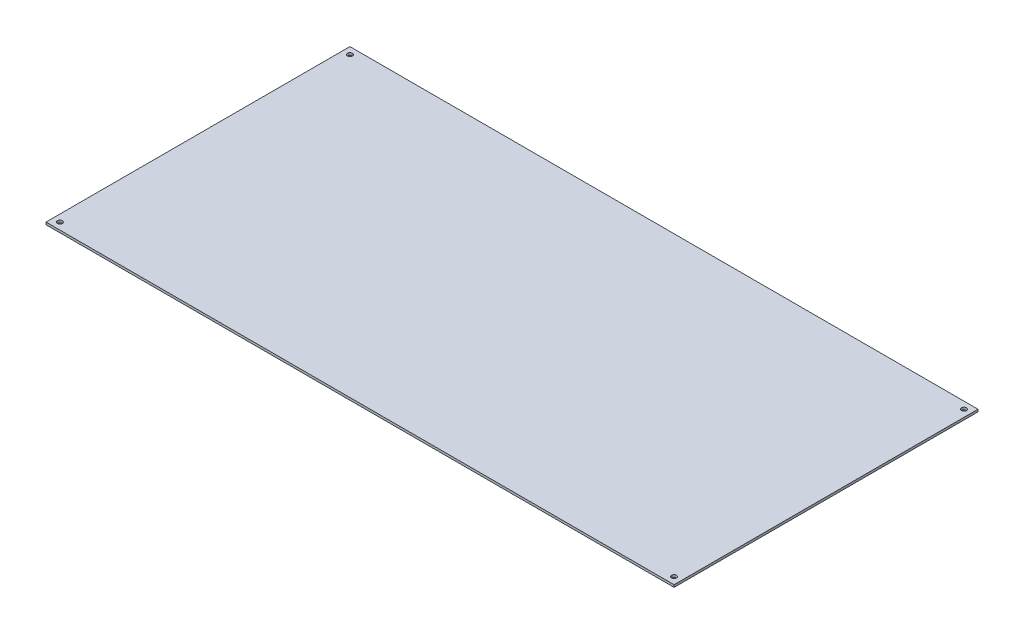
from build123d import *

# Parameters (mm, degrees)
SKETCH1_W          = 629.92
SKETCH1_H          = 304.8
EXTRUDE1_DEPTH     = 2.3622
SKETCH2_R          = 2.4892
CUT_EXTRUDE1_DEPTH = 649.097636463


with BuildPart() as part:
    # Sketch1 → Extrude1 (new body)
    with BuildSketch(Plane(origin=(0, 0, 0), x_dir=(1, 0, 0), z_dir=(0, 1, 0))):
        with Locations((314.96, 0)):
            Rectangle(SKETCH1_W, SKETCH1_H)
    extrude(amount=EXTRUDE1_DEPTH)

    # Sketch2 → Cut-Extrude1 (cut, through all)
    with BuildSketch(Plane(origin=(0, 2.3622, 0), x_dir=(-1, 0, 0), z_dir=(0, 1, 0))):
        with Locations(Location((-6.985, -145.415, 0), (0, 0, 90))):
            Circle(SKETCH2_R)
        with Locations(Location((-6.985, 145.415, 0), (0, 0, 90))):
            Circle(SKETCH2_R)
        with Locations(Location((-622.935, 145.415, 0), (0, 0, 90))):
            Circle(SKETCH2_R)
        with Locations(Location((-622.935, -145.415, 0), (0, 0, 90))):
            Circle(SKETCH2_R)
    extrude(amount=-CUT_EXTRUDE1_DEPTH, mode=Mode.SUBTRACT)


solid = part.part
